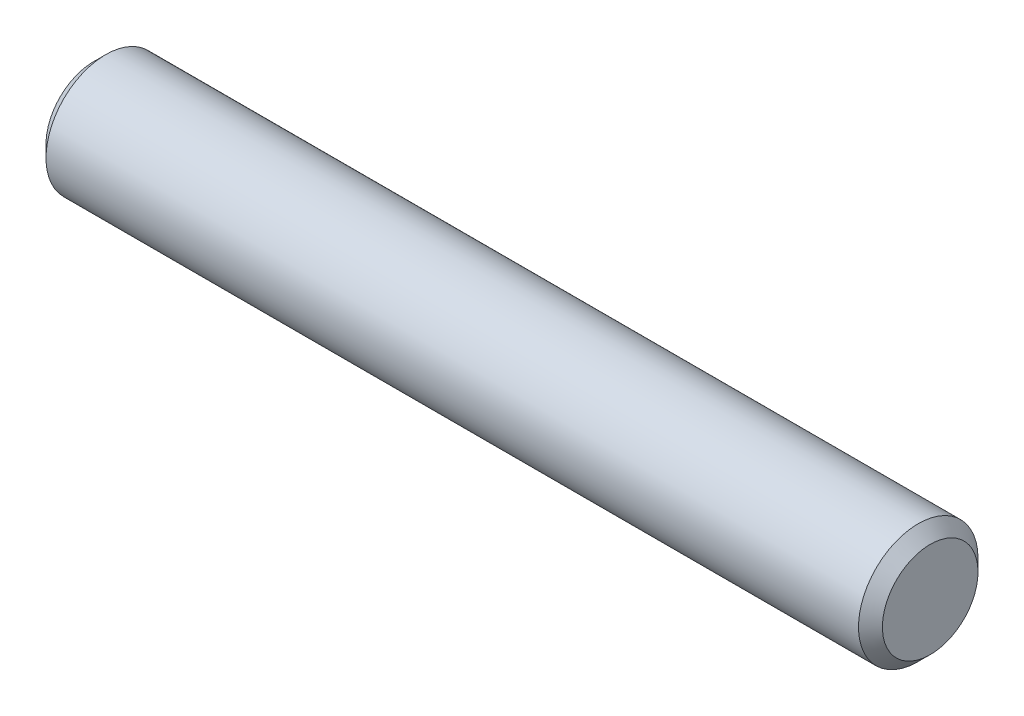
ISO-10303-21;
HEADER;
FILE_DESCRIPTION(('STEP AP214'),'2;1');
FILE_NAME('part.step','',(''),(''),'','','');
FILE_SCHEMA(('AUTOMOTIVE_DESIGN { 1 0 10303 214 1 1 1 1 }'));
ENDSEC;
DATA;
#1=APPLICATION_CONTEXT('core data for automotive mechanical design processes');
#2=APPLICATION_PROTOCOL_DEFINITION('international standard','automotive_design',2000,#1);
#3=PRODUCT_CONTEXT('',#1,'mechanical');
#4=PRODUCT('Part','Part','',(#3));
#5=PRODUCT_RELATED_PRODUCT_CATEGORY('part','',(#4));
#6=PRODUCT_DEFINITION_FORMATION('','',#4);
#7=PRODUCT_DEFINITION_CONTEXT('part definition',#1,'design');
#8=PRODUCT_DEFINITION('design','',#6,#7);
#9=PRODUCT_DEFINITION_SHAPE('','',#8);
#10=(LENGTH_UNIT() NAMED_UNIT(*) SI_UNIT(.MILLI.,.METRE.));
#11=(NAMED_UNIT(*) PLANE_ANGLE_UNIT() SI_UNIT($,.RADIAN.));
#12=(NAMED_UNIT(*) SI_UNIT($,.STERADIAN.) SOLID_ANGLE_UNIT());
#13=UNCERTAINTY_MEASURE_WITH_UNIT(LENGTH_MEASURE(1.E-05),#10,'distance_accuracy_value','');
#14=(GEOMETRIC_REPRESENTATION_CONTEXT(3) GLOBAL_UNCERTAINTY_ASSIGNED_CONTEXT((#13)) GLOBAL_UNIT_ASSIGNED_CONTEXT((#10,
#11,#12)) REPRESENTATION_CONTEXT('',''));
#15=CARTESIAN_POINT('',(0.,0.,0.));
#16=DIRECTION('',(0.,0.,1.));
#17=DIRECTION('',(1.,0.,0.));
#18=AXIS2_PLACEMENT_3D('',#15,#16,#17);
#19=CARTESIAN_POINT('',(-5.55625,0.,0.));
#20=DIRECTION('',(1.,0.,0.));
#21=DIRECTION('',(0.,0.,-1.));
#22=AXIS2_PLACEMENT_3D('',#19,#20,#21);
#23=CYLINDRICAL_SURFACE('',#22,0.79375);
#24=CARTESIAN_POINT('',(5.3975,0.,0.));
#25=DIRECTION('',(1.,0.,0.));
#26=DIRECTION('',(0.,0.,-1.));
#27=AXIS2_PLACEMENT_3D('',#24,#25,#26);
#28=CIRCLE('',#27,0.79375);
#29=CARTESIAN_POINT('',(5.3975,0.,-0.79375));
#30=VERTEX_POINT('',#29);
#31=EDGE_CURVE('E44',#30,#30,#28,.F.);
#32=ORIENTED_EDGE('',*,*,#31,.T.);
#33=EDGE_LOOP('',(#32));
#34=FACE_BOUND('',#33,.T.);
#35=CARTESIAN_POINT('',(-5.3975,0.,0.));
#36=DIRECTION('',(1.,0.,0.));
#37=DIRECTION('',(0.,0.,-1.));
#38=AXIS2_PLACEMENT_3D('',#35,#36,#37);
#39=CIRCLE('',#38,0.79375);
#40=CARTESIAN_POINT('',(-5.3975,0.,-0.79375));
#41=VERTEX_POINT('',#40);
#42=EDGE_CURVE('E51',#41,#41,#39,.T.);
#43=ORIENTED_EDGE('',*,*,#42,.T.);
#44=EDGE_LOOP('',(#43));
#45=FACE_BOUND('',#44,.T.);
#46=ADVANCED_FACE('F36',(#34,#45),#23,.T.);
#47=CARTESIAN_POINT('',(-5.55625,0.,0.));
#48=DIRECTION('',(1.,0.,0.));
#49=DIRECTION('',(0.,0.,-1.));
#50=AXIS2_PLACEMENT_3D('',#47,#48,#49);
#51=PLANE('',#50);
#52=CARTESIAN_POINT('',(-5.55625,0.,0.));
#53=DIRECTION('',(1.,0.,0.));
#54=DIRECTION('',(0.,0.,-1.));
#55=AXIS2_PLACEMENT_3D('',#52,#53,#54);
#56=CIRCLE('',#55,0.634999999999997);
#57=CARTESIAN_POINT('',(-5.55625,0.,-0.634999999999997));
#58=VERTEX_POINT('',#57);
#59=EDGE_CURVE('E10',#58,#58,#56,.F.);
#60=ORIENTED_EDGE('',*,*,#59,.T.);
#61=EDGE_LOOP('',(#60));
#62=FACE_BOUND('',#61,.T.);
#63=ADVANCED_FACE('F71',(#62),#51,.F.);
#64=CARTESIAN_POINT('',(5.55625,0.,0.));
#65=DIRECTION('',(1.,0.,0.));
#66=DIRECTION('',(0.,0.,-1.));
#67=AXIS2_PLACEMENT_3D('',#64,#65,#66);
#68=PLANE('',#67);
#69=CARTESIAN_POINT('',(5.55625,0.,0.));
#70=DIRECTION('',(1.,0.,0.));
#71=DIRECTION('',(0.,0.,-1.));
#72=AXIS2_PLACEMENT_3D('',#69,#70,#71);
#73=CIRCLE('',#72,0.635000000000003);
#74=CARTESIAN_POINT('',(5.55625,0.,-0.635000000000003));
#75=VERTEX_POINT('',#74);
#76=EDGE_CURVE('E55',#75,#75,#73,.T.);
#77=ORIENTED_EDGE('',*,*,#76,.T.);
#78=EDGE_LOOP('',(#77));
#79=FACE_BOUND('',#78,.T.);
#80=ADVANCED_FACE('F61',(#79),#68,.T.);
#81=CARTESIAN_POINT('',(5.55625,0.,0.));
#82=DIRECTION('',(-1.,0.,0.));
#83=DIRECTION('',(0.,0.,1.));
#84=AXIS2_PLACEMENT_3D('',#81,#82,#83);
#85=CONICAL_SURFACE('',#84,0.635000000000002,0.785398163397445);
#86=ORIENTED_EDGE('',*,*,#31,.F.);
#87=EDGE_LOOP('',(#86));
#88=FACE_BOUND('',#87,.T.);
#89=ORIENTED_EDGE('',*,*,#76,.F.);
#90=EDGE_LOOP('',(#89));
#91=FACE_BOUND('',#90,.T.);
#92=ADVANCED_FACE('F63',(#88,#91),#85,.T.);
#93=CARTESIAN_POINT('',(-5.3975,0.,0.));
#94=DIRECTION('',(1.,0.,0.));
#95=DIRECTION('',(0.,0.,-1.));
#96=AXIS2_PLACEMENT_3D('',#93,#94,#95);
#97=CONICAL_SURFACE('',#96,0.79375,0.785398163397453);
#98=ORIENTED_EDGE('',*,*,#59,.F.);
#99=EDGE_LOOP('',(#98));
#100=FACE_BOUND('',#99,.T.);
#101=ORIENTED_EDGE('',*,*,#42,.F.);
#102=EDGE_LOOP('',(#101));
#103=FACE_BOUND('',#102,.T.);
#104=ADVANCED_FACE('F38',(#100,#103),#97,.T.);
#105=CLOSED_SHELL('',(#46,#63,#80,#92,#104));
#106=MANIFOLD_SOLID_BREP('B2',#105);
#107=ADVANCED_BREP_SHAPE_REPRESENTATION('',(#18,#106),#14);
#108=SHAPE_DEFINITION_REPRESENTATION(#9,#107);
ENDSEC;
END-ISO-10303-21;
